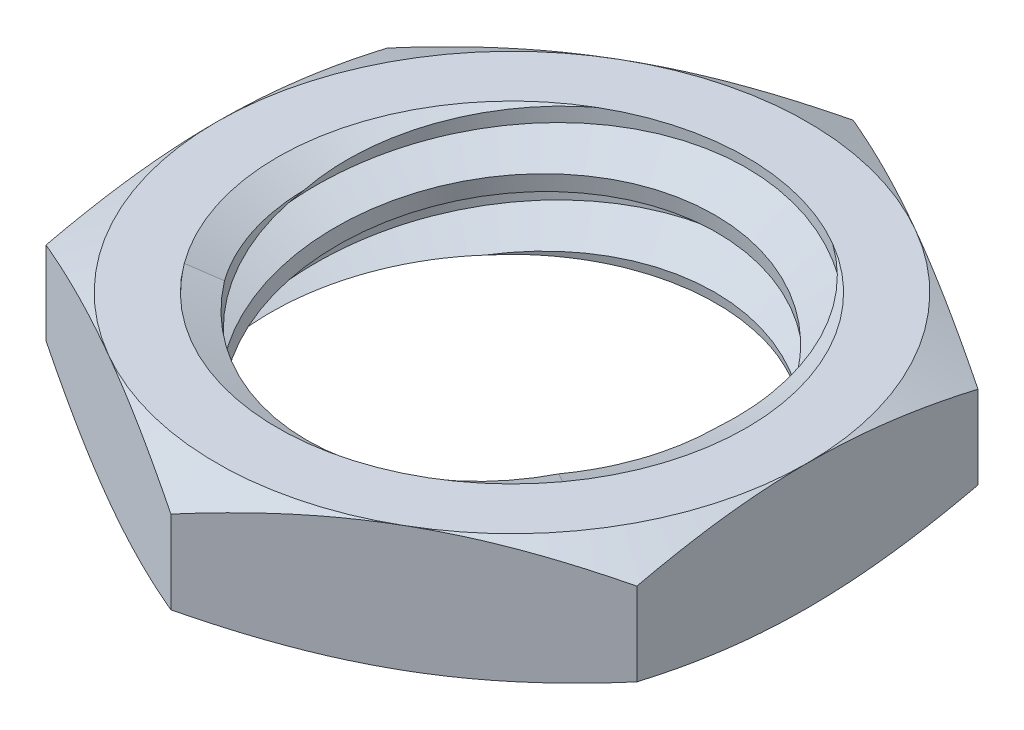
from build123d import *

# Parameters (mm, degrees)
EXTRUDE1_DEPTH      = 1.7
SKETCH2_W           = 3.175
SKETCH2_H           = 1.7
LPATTERN1_COUNT     = 2
LPATTERN1_PITCH     = 0.907142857
LPATTERN1_COL_COUNT = 2
LPATTERN1_COL_PITCH = 0.907142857


with BuildPart() as part:
    # Sketch1 → Extrude1 (new body)
    with BuildSketch(Plane(origin=(0, 0, 0), x_dir=(1, 0, 0), z_dir=(0, 1, 0))):
        Polygon((0, 4.618802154), (-4, 2.309401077), (-4, -2.309401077), (0, -4.618802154), (4, -2.309401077), (4, 2.309401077), align=None)
    extrude(amount=EXTRUDE1_DEPTH)

    # Sketch4 → Cut-Revolve2 (revolve, cut)
    with BuildSketch(Plane(origin=(0, 0, 0), x_dir=(0, 0, -1), z_dir=(1, 0, 0))):
        Polygon((0, 1.7), (3.175, 1.7), (2.74505598, 1.499513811), (2.74505598, 0.200486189), (3.175, 0), (0, 0), align=None)
    revolve(axis=Axis((0, 1.7, 0), (0, 1, 0)), mode=Mode.SUBTRACT)


with BuildPart() as body_2:
    # Sketch2 → Revolve1 (revolve)
    with BuildSketch(Plane(origin=(0, 0, 0), x_dir=(0, 0, -1), z_dir=(1, 0, 0))):
        with Locations((1.5875, 0.85)):
            Rectangle(SKETCH2_W, SKETCH2_H)
    revolve(axis=Axis((0, -3.175, 0), (0, 1, 0)))

    # Sketch3 → Cut-Revolve1 (revolve, cut)
    with BuildSketch(Plane(origin=(0, 0, 0), x_dir=(0, 0, -1), z_dir=(1, 0, 0)), mode=Mode.PRIVATE) as cut_revolve1_sk:
        Polygon((3.191036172, 1.587746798), (3.303289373, 0.801974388), (2.777128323, 1.013168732), (2.74505598, 1.237675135), align=None)
    cut_revolve1 = revolve(cut_revolve1_sk.sketch.rotate(Axis((0, 1.7, 0.1384314), (0, -0.9899494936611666, -0.14142135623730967)), 180), axis=Axis((0, 1.7, 0.1384314), (0, -0.9899494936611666, -0.14142135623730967)), mode=Mode.SUBTRACT)

    # LPattern1: Cut-Revolve1 ×2
    with Locations(*[(0, -i * LPATTERN1_PITCH, 0) for i in range(1, LPATTERN1_COUNT)]):
        add(cut_revolve1, mode=Mode.SUBTRACT)

    # LPattern1 col: Cut-Revolve1 ×2
    with Locations(*[(0, i * LPATTERN1_COL_PITCH, 0) for i in range(1, LPATTERN1_COL_COUNT)]):
        add(cut_revolve1, mode=Mode.SUBTRACT)


with BuildPart() as part_1:
    add(part.part)

    # Combine1: cut body 2
    add(body_2.part, mode=Mode.SUBTRACT)

    # Sketch5 → Cut-Revolve3 (revolve, cut)
    with BuildSketch(Plane(origin=(0, 0, 0), x_dir=(0, 0, -1), z_dir=(1, 0, 0)), mode=Mode.PRIVATE) as cut_revolve3_sk:
        Polygon((0, 0), (4, 0), (4.618802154, 0.288552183), (4.618802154, 1.411447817), (4, 1.7), (0, 1.7), (0, 2.97), (5.888802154, 2.97), (5.888802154, -1.27), (0, -1.27), align=None)
    revolve(cut_revolve3_sk.sketch.rotate(Axis((0, 0, 0), (0, 1, 0)), 329.794218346), axis=Axis((0, 0, 0), (0, 1, 0)), mode=Mode.SUBTRACT)


solid = part_1.part
